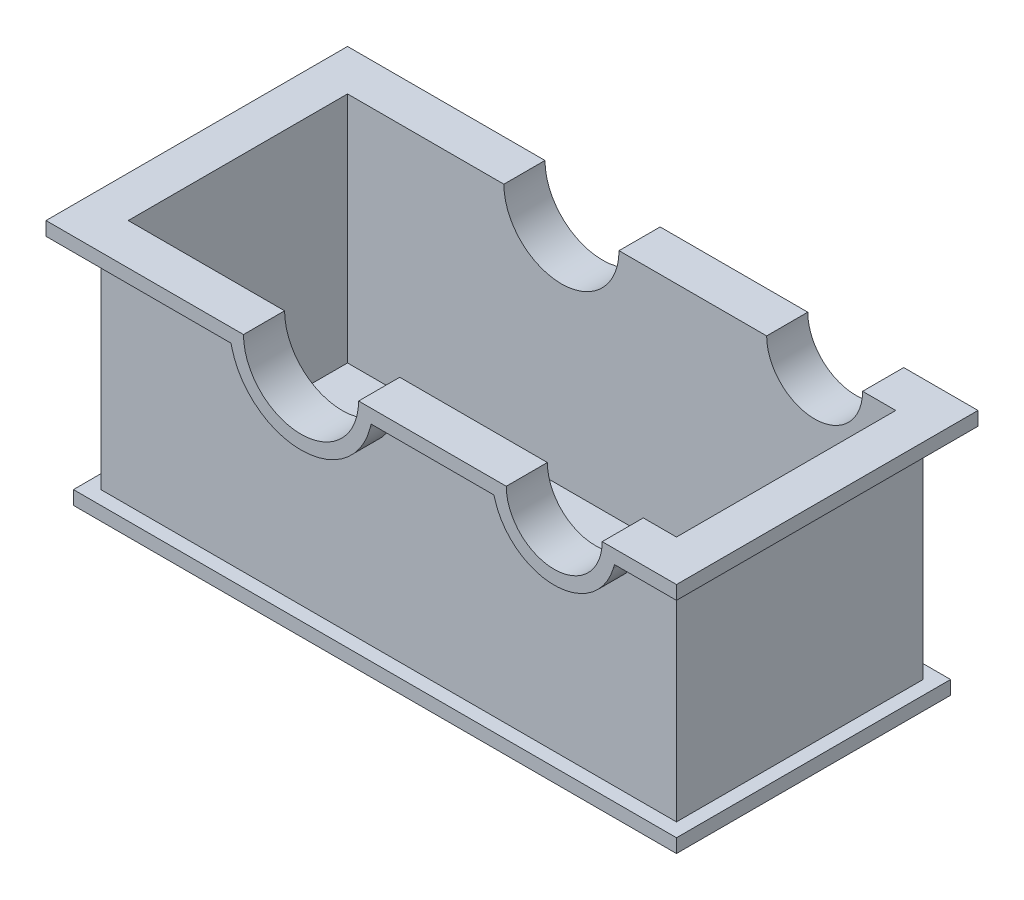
ISO-10303-21;
HEADER;
FILE_DESCRIPTION(('STEP AP214'),'2;1');
FILE_NAME('part.step','',(''),(''),'','','');
FILE_SCHEMA(('AUTOMOTIVE_DESIGN { 1 0 10303 214 1 1 1 1 }'));
ENDSEC;
DATA;
#1=APPLICATION_CONTEXT('core data for automotive mechanical design processes');
#2=APPLICATION_PROTOCOL_DEFINITION('international standard','automotive_design',2000,#1);
#3=PRODUCT_CONTEXT('',#1,'mechanical');
#4=PRODUCT('Part','Part','',(#3));
#5=PRODUCT_RELATED_PRODUCT_CATEGORY('part','',(#4));
#6=PRODUCT_DEFINITION_FORMATION('','',#4);
#7=PRODUCT_DEFINITION_CONTEXT('part definition',#1,'design');
#8=PRODUCT_DEFINITION('design','',#6,#7);
#9=PRODUCT_DEFINITION_SHAPE('','',#8);
#10=(LENGTH_UNIT() NAMED_UNIT(*) SI_UNIT(.MILLI.,.METRE.));
#11=(NAMED_UNIT(*) PLANE_ANGLE_UNIT() SI_UNIT($,.RADIAN.));
#12=(NAMED_UNIT(*) SI_UNIT($,.STERADIAN.) SOLID_ANGLE_UNIT());
#13=UNCERTAINTY_MEASURE_WITH_UNIT(LENGTH_MEASURE(1.E-05),#10,'distance_accuracy_value','');
#14=(GEOMETRIC_REPRESENTATION_CONTEXT(3) GLOBAL_UNCERTAINTY_ASSIGNED_CONTEXT((#13)) GLOBAL_UNIT_ASSIGNED_CONTEXT((#10,
#11,#12)) REPRESENTATION_CONTEXT('',''));
#15=CARTESIAN_POINT('',(0.,0.,0.));
#16=DIRECTION('',(0.,0.,1.));
#17=DIRECTION('',(1.,0.,0.));
#18=AXIS2_PLACEMENT_3D('',#15,#16,#17);
#19=CARTESIAN_POINT('',(0.,85.,0.));
#20=DIRECTION('',(0.,1.,0.));
#21=DIRECTION('',(0.,0.,1.));
#22=AXIS2_PLACEMENT_3D('',#19,#20,#21);
#23=PLANE('',#22);
#24=DIRECTION('',(0.,0.,1.));
#25=VECTOR('',#24,1.);
#26=CARTESIAN_POINT('',(108.583492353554,85.,-100.));
#27=LINE('',#26,#25);
#28=CARTESIAN_POINT('',(108.583492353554,85.,-100.));
#29=VERTEX_POINT('',#28);
#30=CARTESIAN_POINT('',(108.583492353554,85.,-90.));
#31=VERTEX_POINT('',#30);
#32=EDGE_CURVE('E326',#29,#31,#27,.T.);
#33=ORIENTED_EDGE('',*,*,#32,.F.);
#34=DIRECTION('',(-1.,0.,0.));
#35=VECTOR('',#34,1.);
#36=CARTESIAN_POINT('',(-10.,85.,-100.));
#37=LINE('',#36,#35);
#38=CARTESIAN_POINT('',(153.411363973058,85.,-100.));
#39=VERTEX_POINT('',#38);
#40=EDGE_CURVE('E474',#39,#29,#37,.T.);
#41=ORIENTED_EDGE('',*,*,#40,.F.);
#42=DIRECTION('',(0.,0.,1.));
#43=VECTOR('',#42,1.);
#44=CARTESIAN_POINT('',(153.411363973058,85.,-100.));
#45=LINE('',#44,#43);
#46=CARTESIAN_POINT('',(153.411363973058,85.,-90.));
#47=VERTEX_POINT('',#46);
#48=EDGE_CURVE('E349',#39,#47,#45,.T.);
#49=ORIENTED_EDGE('',*,*,#48,.T.);
#50=DIRECTION('',(-1.,0.,0.));
#51=VECTOR('',#50,1.);
#52=CARTESIAN_POINT('',(0.,85.,-90.));
#53=LINE('',#52,#51);
#54=EDGE_CURVE('E521',#47,#31,#53,.T.);
#55=ORIENTED_EDGE('',*,*,#54,.T.);
#56=EDGE_LOOP('',(#33,#41,#49,#55));
#57=FACE_BOUND('',#56,.T.);
#58=ADVANCED_FACE('F44',(#57),#23,.F.);
#59=CARTESIAN_POINT('',(0.,85.,-90.));
#60=DIRECTION('',(0.,0.,1.));
#61=DIRECTION('',(1.,0.,0.));
#62=AXIS2_PLACEMENT_3D('',#59,#60,#61);
#63=PLANE('',#62);
#64=DIRECTION('',(-0.238095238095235,0.971241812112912,0.));
#65=VECTOR('',#64,1.);
#66=CARTESIAN_POINT('',(57.7870786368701,83.8095238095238,-90.));
#67=LINE('',#66,#65);
#68=CARTESIAN_POINT('',(57.7870786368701,83.8095238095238,-90.));
#69=VERTEX_POINT('',#68);
#70=CARTESIAN_POINT('',(57.4952391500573,85.,-90.));
#71=VERTEX_POINT('',#70);
#72=EDGE_CURVE('E59',#69,#71,#67,.T.);
#73=ORIENTED_EDGE('',*,*,#72,.F.);
#74=CARTESIAN_POINT('',(83.0393657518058,90.,-90.));
#75=DIRECTION('',(0.,0.,-1.));
#76=DIRECTION('',(-1.,0.,0.));
#77=AXIS2_PLACEMENT_3D('',#74,#75,#76);
#78=CIRCLE('',#77,26.);
#79=CARTESIAN_POINT('',(108.291652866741,83.8095238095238,-90.));
#80=VERTEX_POINT('',#79);
#81=EDGE_CURVE('E64',#80,#69,#78,.T.);
#82=ORIENTED_EDGE('',*,*,#81,.F.);
#83=DIRECTION('',(-0.238095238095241,-0.971241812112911,0.));
#84=VECTOR('',#83,1.);
#85=CARTESIAN_POINT('',(108.291652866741,83.8095238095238,-90.));
#86=LINE('',#85,#84);
#87=EDGE_CURVE('E318',#31,#80,#86,.T.);
#88=ORIENTED_EDGE('',*,*,#87,.F.);
#89=ORIENTED_EDGE('',*,*,#54,.F.);
#90=DIRECTION('',(-0.285714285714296,0.958314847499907,0.));
#91=VECTOR('',#90,1.);
#92=CARTESIAN_POINT('',(153.837281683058,83.5714285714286,-90.));
#93=LINE('',#92,#91);
#94=CARTESIAN_POINT('',(153.837281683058,83.5714285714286,-90.));
#95=VERTEX_POINT('',#94);
#96=EDGE_CURVE('E324',#95,#47,#93,.T.);
#97=ORIENTED_EDGE('',*,*,#96,.F.);
#98=CARTESIAN_POINT('',(175.399365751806,90.,-90.));
#99=DIRECTION('',(0.,0.,-1.));
#100=DIRECTION('',(-1.,0.,0.));
#101=AXIS2_PLACEMENT_3D('',#98,#99,#100);
#102=CIRCLE('',#101,22.5);
#103=CARTESIAN_POINT('',(196.961449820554,83.5714285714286,-90.));
#104=VERTEX_POINT('',#103);
#105=EDGE_CURVE('E321',#104,#95,#102,.T.);
#106=ORIENTED_EDGE('',*,*,#105,.F.);
#107=DIRECTION('',(-0.285714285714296,-0.958314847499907,0.));
#108=VECTOR('',#107,1.);
#109=CARTESIAN_POINT('',(196.961449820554,83.5714285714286,-90.));
#110=LINE('',#109,#108);
#111=CARTESIAN_POINT('',(197.387367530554,85.,-90.));
#112=VERTEX_POINT('',#111);
#113=EDGE_CURVE('E334',#112,#104,#110,.T.);
#114=ORIENTED_EDGE('',*,*,#113,.F.);
#115=CARTESIAN_POINT('',(210.,85.,-90.));
#116=VERTEX_POINT('',#115);
#117=EDGE_CURVE('E517',#116,#112,#53,.T.);
#118=ORIENTED_EDGE('',*,*,#117,.F.);
#119=DIRECTION('',(0.,-1.,0.));
#120=VECTOR('',#119,1.);
#121=CARTESIAN_POINT('',(210.,85.,-90.));
#122=LINE('',#121,#120);
#123=CARTESIAN_POINT('',(210.,5.,-90.));
#124=VERTEX_POINT('',#123);
#125=EDGE_CURVE('E538',#116,#124,#122,.T.);
#126=ORIENTED_EDGE('',*,*,#125,.T.);
#127=DIRECTION('',(-1.,0.,0.));
#128=VECTOR('',#127,1.);
#129=CARTESIAN_POINT('',(0.,5.,-90.));
#130=LINE('',#129,#128);
#131=CARTESIAN_POINT('',(0.,5.,-90.));
#132=VERTEX_POINT('',#131);
#133=EDGE_CURVE('E529',#124,#132,#130,.T.);
#134=ORIENTED_EDGE('',*,*,#133,.T.);
#135=DIRECTION('',(0.,-1.,0.));
#136=VECTOR('',#135,1.);
#137=CARTESIAN_POINT('',(0.,85.,-90.));
#138=LINE('',#137,#136);
#139=CARTESIAN_POINT('',(0.,85.,-90.));
#140=VERTEX_POINT('',#139);
#141=EDGE_CURVE('E536',#140,#132,#138,.T.);
#142=ORIENTED_EDGE('',*,*,#141,.F.);
#143=EDGE_CURVE('E516',#71,#140,#53,.T.);
#144=ORIENTED_EDGE('',*,*,#143,.F.);
#145=EDGE_LOOP('',(#73,#82,#88,#89,#97,#106,#114,#118,#126,#134,#142,#144));
#146=FACE_BOUND('',#145,.T.);
#147=ADVANCED_FACE('F664',(#146),#63,.F.);
#148=DIRECTION('',(0.,0.,1.));
#149=VECTOR('',#148,1.);
#150=CARTESIAN_POINT('',(57.4952391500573,85.,-100.));
#151=LINE('',#150,#149);
#152=CARTESIAN_POINT('',(57.4952391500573,85.,-100.));
#153=VERTEX_POINT('',#152);
#154=EDGE_CURVE('E305',#153,#71,#151,.T.);
#155=ORIENTED_EDGE('',*,*,#154,.T.);
#156=ORIENTED_EDGE('',*,*,#143,.T.);
#157=DIRECTION('',(0.,0.,1.));
#158=VECTOR('',#157,1.);
#159=CARTESIAN_POINT('',(0.,85.,0.));
#160=LINE('',#159,#158);
#161=CARTESIAN_POINT('',(0.,85.,0.));
#162=VERTEX_POINT('',#161);
#163=EDGE_CURVE('E520',#140,#162,#160,.T.);
#164=ORIENTED_EDGE('',*,*,#163,.T.);
#165=DIRECTION('',(1.,0.,0.));
#166=VECTOR('',#165,1.);
#167=CARTESIAN_POINT('',(0.,85.,0.));
#168=LINE('',#167,#166);
#169=CARTESIAN_POINT('',(57.4952391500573,85.,0.));
#170=VERTEX_POINT('',#169);
#171=EDGE_CURVE('E508',#162,#170,#168,.T.);
#172=ORIENTED_EDGE('',*,*,#171,.T.);
#173=DIRECTION('',(0.,0.,-1.));
#174=VECTOR('',#173,1.);
#175=CARTESIAN_POINT('',(57.4952391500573,85.,10.));
#176=LINE('',#175,#174);
#177=CARTESIAN_POINT('',(57.4952391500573,85.,10.));
#178=VERTEX_POINT('',#177);
#179=EDGE_CURVE('E405',#178,#170,#176,.T.);
#180=ORIENTED_EDGE('',*,*,#179,.F.);
#181=DIRECTION('',(1.,0.,0.));
#182=VECTOR('',#181,1.);
#183=CARTESIAN_POINT('',(-10.,85.,10.));
#184=LINE('',#183,#182);
#185=CARTESIAN_POINT('',(-10.,85.,10.));
#186=VERTEX_POINT('',#185);
#187=EDGE_CURVE('E464',#186,#178,#184,.T.);
#188=ORIENTED_EDGE('',*,*,#187,.F.);
#189=DIRECTION('',(0.,0.,1.));
#190=VECTOR('',#189,1.);
#191=CARTESIAN_POINT('',(-10.,85.,10.));
#192=LINE('',#191,#190);
#193=CARTESIAN_POINT('',(-10.,85.,-100.));
#194=VERTEX_POINT('',#193);
#195=EDGE_CURVE('E473',#194,#186,#192,.T.);
#196=ORIENTED_EDGE('',*,*,#195,.F.);
#197=EDGE_CURVE('E470',#153,#194,#37,.T.);
#198=ORIENTED_EDGE('',*,*,#197,.F.);
#199=EDGE_LOOP('',(#155,#156,#164,#172,#180,#188,#196,#198));
#200=FACE_BOUND('',#199,.T.);
#201=ADVANCED_FACE('F667',(#200),#23,.F.);
#202=DIRECTION('',(0.,0.,1.));
#203=VECTOR('',#202,1.);
#204=CARTESIAN_POINT('',(197.387367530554,85.,-100.));
#205=LINE('',#204,#203);
#206=CARTESIAN_POINT('',(197.387367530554,85.,-100.));
#207=VERTEX_POINT('',#206);
#208=EDGE_CURVE('E346',#207,#112,#205,.T.);
#209=ORIENTED_EDGE('',*,*,#208,.F.);
#210=CARTESIAN_POINT('',(220.,85.,-100.));
#211=VERTEX_POINT('',#210);
#212=EDGE_CURVE('E471',#211,#207,#37,.T.);
#213=ORIENTED_EDGE('',*,*,#212,.F.);
#214=DIRECTION('',(0.,0.,-1.));
#215=VECTOR('',#214,1.);
#216=CARTESIAN_POINT('',(220.,85.,10.));
#217=LINE('',#216,#215);
#218=CARTESIAN_POINT('',(220.,85.,10.));
#219=VERTEX_POINT('',#218);
#220=EDGE_CURVE('E467',#219,#211,#217,.T.);
#221=ORIENTED_EDGE('',*,*,#220,.F.);
#222=CARTESIAN_POINT('',(197.387367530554,85.,10.));
#223=VERTEX_POINT('',#222);
#224=EDGE_CURVE('E448',#223,#219,#184,.T.);
#225=ORIENTED_EDGE('',*,*,#224,.F.);
#226=DIRECTION('',(0.,0.,-1.));
#227=VECTOR('',#226,1.);
#228=CARTESIAN_POINT('',(197.387367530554,85.,10.));
#229=LINE('',#228,#227);
#230=CARTESIAN_POINT('',(197.387367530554,85.,0.));
#231=VERTEX_POINT('',#230);
#232=EDGE_CURVE('E363',#223,#231,#229,.T.);
#233=ORIENTED_EDGE('',*,*,#232,.T.);
#234=CARTESIAN_POINT('',(210.,85.,0.));
#235=VERTEX_POINT('',#234);
#236=EDGE_CURVE('E513',#231,#235,#168,.T.);
#237=ORIENTED_EDGE('',*,*,#236,.T.);
#238=DIRECTION('',(0.,0.,-1.));
#239=VECTOR('',#238,1.);
#240=CARTESIAN_POINT('',(210.,85.,0.));
#241=LINE('',#240,#239);
#242=EDGE_CURVE('E511',#235,#116,#241,.T.);
#243=ORIENTED_EDGE('',*,*,#242,.T.);
#244=ORIENTED_EDGE('',*,*,#117,.T.);
#245=EDGE_LOOP('',(#209,#213,#221,#225,#233,#237,#243,#244));
#246=FACE_BOUND('',#245,.T.);
#247=ADVANCED_FACE('F648',(#246),#23,.F.);
#248=DIRECTION('',(0.,0.,-1.));
#249=VECTOR('',#248,1.);
#250=CARTESIAN_POINT('',(153.411363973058,85.,10.));
#251=LINE('',#250,#249);
#252=CARTESIAN_POINT('',(153.411363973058,85.,10.));
#253=VERTEX_POINT('',#252);
#254=CARTESIAN_POINT('',(153.411363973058,85.,0.));
#255=VERTEX_POINT('',#254);
#256=EDGE_CURVE('E378',#253,#255,#251,.T.);
#257=ORIENTED_EDGE('',*,*,#256,.F.);
#258=CARTESIAN_POINT('',(108.583492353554,85.,10.));
#259=VERTEX_POINT('',#258);
#260=EDGE_CURVE('E468',#259,#253,#184,.T.);
#261=ORIENTED_EDGE('',*,*,#260,.F.);
#262=DIRECTION('',(0.,0.,-1.));
#263=VECTOR('',#262,1.);
#264=CARTESIAN_POINT('',(108.583492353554,85.,10.));
#265=LINE('',#264,#263);
#266=CARTESIAN_POINT('',(108.583492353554,85.,0.));
#267=VERTEX_POINT('',#266);
#268=EDGE_CURVE('E390',#259,#267,#265,.T.);
#269=ORIENTED_EDGE('',*,*,#268,.T.);
#270=EDGE_CURVE('E512',#267,#255,#168,.T.);
#271=ORIENTED_EDGE('',*,*,#270,.T.);
#272=EDGE_LOOP('',(#257,#261,#269,#271));
#273=FACE_BOUND('',#272,.T.);
#274=ADVANCED_FACE('F701',(#273),#23,.F.);
#275=CARTESIAN_POINT('',(0.,85.,0.));
#276=DIRECTION('',(0.,0.,-1.));
#277=DIRECTION('',(-1.,0.,0.));
#278=AXIS2_PLACEMENT_3D('',#275,#276,#277);
#279=PLANE('',#278);
#280=DIRECTION('',(0.285714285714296,-0.958314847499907,0.));
#281=VECTOR('',#280,1.);
#282=CARTESIAN_POINT('',(153.837281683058,83.5714285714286,0.));
#283=LINE('',#282,#281);
#284=CARTESIAN_POINT('',(153.837281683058,83.5714285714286,0.));
#285=VERTEX_POINT('',#284);
#286=EDGE_CURVE('E354',#255,#285,#283,.T.);
#287=ORIENTED_EDGE('',*,*,#286,.F.);
#288=ORIENTED_EDGE('',*,*,#270,.F.);
#289=DIRECTION('',(0.238095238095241,0.971241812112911,0.));
#290=VECTOR('',#289,1.);
#291=CARTESIAN_POINT('',(108.291652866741,83.8095238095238,0.));
#292=LINE('',#291,#290);
#293=CARTESIAN_POINT('',(108.291652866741,83.8095238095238,0.));
#294=VERTEX_POINT('',#293);
#295=EDGE_CURVE('E385',#294,#267,#292,.T.);
#296=ORIENTED_EDGE('',*,*,#295,.F.);
#297=CARTESIAN_POINT('',(83.0393657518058,90.,0.));
#298=DIRECTION('',(0.,0.,1.));
#299=DIRECTION('',(1.,0.,0.));
#300=AXIS2_PLACEMENT_3D('',#297,#298,#299);
#301=CIRCLE('',#300,26.);
#302=CARTESIAN_POINT('',(57.7870786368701,83.8095238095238,0.));
#303=VERTEX_POINT('',#302);
#304=EDGE_CURVE('E393',#303,#294,#301,.T.);
#305=ORIENTED_EDGE('',*,*,#304,.F.);
#306=DIRECTION('',(0.238095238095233,-0.971241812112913,0.));
#307=VECTOR('',#306,1.);
#308=CARTESIAN_POINT('',(57.7870786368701,83.8095238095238,0.));
#309=LINE('',#308,#307);
#310=EDGE_CURVE('E381',#170,#303,#309,.T.);
#311=ORIENTED_EDGE('',*,*,#310,.F.);
#312=ORIENTED_EDGE('',*,*,#171,.F.);
#313=DIRECTION('',(0.,-1.,0.));
#314=VECTOR('',#313,1.);
#315=CARTESIAN_POINT('',(0.,85.,0.));
#316=LINE('',#315,#314);
#317=CARTESIAN_POINT('',(0.,5.,0.));
#318=VERTEX_POINT('',#317);
#319=EDGE_CURVE('E524',#162,#318,#316,.T.);
#320=ORIENTED_EDGE('',*,*,#319,.T.);
#321=DIRECTION('',(1.,0.,0.));
#322=VECTOR('',#321,1.);
#323=CARTESIAN_POINT('',(0.,5.,0.));
#324=LINE('',#323,#322);
#325=CARTESIAN_POINT('',(210.,5.,0.));
#326=VERTEX_POINT('',#325);
#327=EDGE_CURVE('E507',#318,#326,#324,.T.);
#328=ORIENTED_EDGE('',*,*,#327,.T.);
#329=DIRECTION('',(0.,-1.,0.));
#330=VECTOR('',#329,1.);
#331=CARTESIAN_POINT('',(210.,85.,0.));
#332=LINE('',#331,#330);
#333=EDGE_CURVE('E541',#235,#326,#332,.T.);
#334=ORIENTED_EDGE('',*,*,#333,.F.);
#335=ORIENTED_EDGE('',*,*,#236,.F.);
#336=DIRECTION('',(0.285714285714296,0.958314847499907,0.));
#337=VECTOR('',#336,1.);
#338=CARTESIAN_POINT('',(196.961449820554,83.5714285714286,0.));
#339=LINE('',#338,#337);
#340=CARTESIAN_POINT('',(196.961449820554,83.5714285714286,0.));
#341=VERTEX_POINT('',#340);
#342=EDGE_CURVE('E358',#341,#231,#339,.T.);
#343=ORIENTED_EDGE('',*,*,#342,.F.);
#344=CARTESIAN_POINT('',(175.399365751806,90.,0.));
#345=DIRECTION('',(0.,0.,1.));
#346=DIRECTION('',(1.,0.,0.));
#347=AXIS2_PLACEMENT_3D('',#344,#345,#346);
#348=CIRCLE('',#347,22.5);
#349=EDGE_CURVE('E366',#285,#341,#348,.T.);
#350=ORIENTED_EDGE('',*,*,#349,.F.);
#351=EDGE_LOOP('',(#287,#288,#296,#305,#311,#312,#320,#328,#334,#335,#343,#350));
#352=FACE_BOUND('',#351,.T.);
#353=ADVANCED_FACE('F676',(#352),#279,.F.);
#354=CARTESIAN_POINT('',(0.,90.,0.));
#355=DIRECTION('',(0.,1.,0.));
#356=DIRECTION('',(0.,0.,1.));
#357=AXIS2_PLACEMENT_3D('',#354,#355,#356);
#358=PLANE('',#357);
#359=DIRECTION('',(0.,0.,1.));
#360=VECTOR('',#359,1.);
#361=CARTESIAN_POINT('',(62.0393657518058,90.,-100.));
#362=LINE('',#361,#360);
#363=CARTESIAN_POINT('',(62.0393657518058,90.,-100.));
#364=VERTEX_POINT('',#363);
#365=CARTESIAN_POINT('',(62.0393657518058,90.,-85.));
#366=VERTEX_POINT('',#365);
#367=EDGE_CURVE('E430',#364,#366,#362,.T.);
#368=ORIENTED_EDGE('',*,*,#367,.F.);
#369=DIRECTION('',(-1.,0.,0.));
#370=VECTOR('',#369,1.);
#371=CARTESIAN_POINT('',(-10.,90.,-100.));
#372=LINE('',#371,#370);
#373=CARTESIAN_POINT('',(-10.,90.,-100.));
#374=VERTEX_POINT('',#373);
#375=EDGE_CURVE('E456',#364,#374,#372,.T.);
#376=ORIENTED_EDGE('',*,*,#375,.T.);
#377=DIRECTION('',(0.,0.,1.));
#378=VECTOR('',#377,1.);
#379=CARTESIAN_POINT('',(-10.,90.,10.));
#380=LINE('',#379,#378);
#381=CARTESIAN_POINT('',(-10.,90.,10.));
#382=VERTEX_POINT('',#381);
#383=EDGE_CURVE('E460',#374,#382,#380,.T.);
#384=ORIENTED_EDGE('',*,*,#383,.T.);
#385=DIRECTION('',(1.,0.,0.));
#386=VECTOR('',#385,1.);
#387=CARTESIAN_POINT('',(-10.,90.,10.));
#388=LINE('',#387,#386);
#389=CARTESIAN_POINT('',(62.0393657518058,90.,10.));
#390=VERTEX_POINT('',#389);
#391=EDGE_CURVE('E449',#382,#390,#388,.T.);
#392=ORIENTED_EDGE('',*,*,#391,.T.);
#393=CARTESIAN_POINT('',(62.0393657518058,90.,-5.));
#394=VERTEX_POINT('',#393);
#395=EDGE_CURVE('E426',#394,#390,#362,.T.);
#396=ORIENTED_EDGE('',*,*,#395,.F.);
#397=DIRECTION('',(1.,0.,0.));
#398=VECTOR('',#397,1.);
#399=CARTESIAN_POINT('',(5.,90.,-5.));
#400=LINE('',#399,#398);
#401=CARTESIAN_POINT('',(5.,90.,-5.));
#402=VERTEX_POINT('',#401);
#403=EDGE_CURVE('E432',#402,#394,#400,.T.);
#404=ORIENTED_EDGE('',*,*,#403,.F.);
#405=DIRECTION('',(0.,0.,1.));
#406=VECTOR('',#405,1.);
#407=CARTESIAN_POINT('',(5.,90.,-5.));
#408=LINE('',#407,#406);
#409=CARTESIAN_POINT('',(5.,90.,-85.));
#410=VERTEX_POINT('',#409);
#411=EDGE_CURVE('E444',#410,#402,#408,.T.);
#412=ORIENTED_EDGE('',*,*,#411,.F.);
#413=DIRECTION('',(-1.,0.,0.));
#414=VECTOR('',#413,1.);
#415=CARTESIAN_POINT('',(5.,90.,-85.));
#416=LINE('',#415,#414);
#417=EDGE_CURVE('E440',#366,#410,#416,.T.);
#418=ORIENTED_EDGE('',*,*,#417,.F.);
#419=EDGE_LOOP('',(#368,#376,#384,#392,#396,#404,#412,#418));
#420=FACE_BOUND('',#419,.T.);
#421=ADVANCED_FACE('F608',(#420),#358,.T.);
#422=DIRECTION('',(0.,0.,1.));
#423=VECTOR('',#422,1.);
#424=CARTESIAN_POINT('',(104.039365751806,90.,-100.));
#425=LINE('',#424,#423);
#426=CARTESIAN_POINT('',(104.039365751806,90.,10.));
#427=VERTEX_POINT('',#426);
#428=CARTESIAN_POINT('',(104.039365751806,90.,-5.));
#429=VERTEX_POINT('',#428);
#430=EDGE_CURVE('E424',#427,#429,#425,.F.);
#431=ORIENTED_EDGE('',*,*,#430,.F.);
#432=CARTESIAN_POINT('',(157.899365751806,90.,10.));
#433=VERTEX_POINT('',#432);
#434=EDGE_CURVE('E453',#427,#433,#388,.T.);
#435=ORIENTED_EDGE('',*,*,#434,.T.);
#436=DIRECTION('',(0.,0.,1.));
#437=VECTOR('',#436,1.);
#438=CARTESIAN_POINT('',(157.899365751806,90.,-100.));
#439=LINE('',#438,#437);
#440=CARTESIAN_POINT('',(157.899365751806,90.,-5.));
#441=VERTEX_POINT('',#440);
#442=EDGE_CURVE('E418',#441,#433,#439,.T.);
#443=ORIENTED_EDGE('',*,*,#442,.F.);
#444=EDGE_CURVE('E436',#429,#441,#400,.T.);
#445=ORIENTED_EDGE('',*,*,#444,.F.);
#446=EDGE_LOOP('',(#431,#435,#443,#445));
#447=FACE_BOUND('',#446,.T.);
#448=ADVANCED_FACE('F587',(#447),#358,.T.);
#449=CARTESIAN_POINT('',(104.039365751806,90.,-85.));
#450=VERTEX_POINT('',#449);
#451=CARTESIAN_POINT('',(104.039365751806,90.,-100.));
#452=VERTEX_POINT('',#451);
#453=EDGE_CURVE('E427',#450,#452,#425,.F.);
#454=ORIENTED_EDGE('',*,*,#453,.F.);
#455=CARTESIAN_POINT('',(157.899365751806,90.,-85.));
#456=VERTEX_POINT('',#455);
#457=EDGE_CURVE('E445',#456,#450,#416,.T.);
#458=ORIENTED_EDGE('',*,*,#457,.F.);
#459=CARTESIAN_POINT('',(157.899365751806,90.,-100.));
#460=VERTEX_POINT('',#459);
#461=EDGE_CURVE('E422',#460,#456,#439,.T.);
#462=ORIENTED_EDGE('',*,*,#461,.F.);
#463=EDGE_CURVE('E461',#460,#452,#372,.T.);
#464=ORIENTED_EDGE('',*,*,#463,.T.);
#465=EDGE_LOOP('',(#454,#458,#462,#464));
#466=FACE_BOUND('',#465,.T.);
#467=ADVANCED_FACE('F604',(#466),#358,.T.);
#468=CARTESIAN_POINT('',(0.,5.,0.));
#469=DIRECTION('',(0.,1.,0.));
#470=DIRECTION('',(0.,0.,1.));
#471=AXIS2_PLACEMENT_3D('',#468,#469,#470);
#472=PLANE('',#471);
#473=DIRECTION('',(1.,0.,0.));
#474=VECTOR('',#473,1.);
#475=CARTESIAN_POINT('',(-5.,5.,5.));
#476=LINE('',#475,#474);
#477=CARTESIAN_POINT('',(-5.,5.,5.));
#478=VERTEX_POINT('',#477);
#479=CARTESIAN_POINT('',(215.,5.,5.));
#480=VERTEX_POINT('',#479);
#481=EDGE_CURVE('E544',#478,#480,#476,.T.);
#482=ORIENTED_EDGE('',*,*,#481,.T.);
#483=DIRECTION('',(0.,0.,-1.));
#484=VECTOR('',#483,1.);
#485=CARTESIAN_POINT('',(215.,5.,5.));
#486=LINE('',#485,#484);
#487=CARTESIAN_POINT('',(215.,5.,-95.));
#488=VERTEX_POINT('',#487);
#489=EDGE_CURVE('E547',#480,#488,#486,.T.);
#490=ORIENTED_EDGE('',*,*,#489,.T.);
#491=DIRECTION('',(1.,0.,0.));
#492=VECTOR('',#491,1.);
#493=CARTESIAN_POINT('',(-5.,5.,-95.));
#494=LINE('',#493,#492);
#495=CARTESIAN_POINT('',(-5.,5.,-95.));
#496=VERTEX_POINT('',#495);
#497=EDGE_CURVE('E550',#496,#488,#494,.T.);
#498=ORIENTED_EDGE('',*,*,#497,.F.);
#499=DIRECTION('',(0.,0.,-1.));
#500=VECTOR('',#499,1.);
#501=CARTESIAN_POINT('',(-5.,5.,5.));
#502=LINE('',#501,#500);
#503=EDGE_CURVE('E553',#478,#496,#502,.T.);
#504=ORIENTED_EDGE('',*,*,#503,.F.);
#505=EDGE_LOOP('',(#482,#490,#498,#504));
#506=FACE_BOUND('',#505,.T.);
#507=DIRECTION('',(0.,0.,-1.));
#508=VECTOR('',#507,1.);
#509=CARTESIAN_POINT('',(210.,5.,0.));
#510=LINE('',#509,#508);
#511=EDGE_CURVE('E527',#326,#124,#510,.T.);
#512=ORIENTED_EDGE('',*,*,#511,.F.);
#513=ORIENTED_EDGE('',*,*,#327,.F.);
#514=DIRECTION('',(0.,0.,1.));
#515=VECTOR('',#514,1.);
#516=CARTESIAN_POINT('',(0.,5.,0.));
#517=LINE('',#516,#515);
#518=EDGE_CURVE('E532',#132,#318,#517,.T.);
#519=ORIENTED_EDGE('',*,*,#518,.F.);
#520=ORIENTED_EDGE('',*,*,#133,.F.);
#521=EDGE_LOOP('',(#512,#513,#519,#520));
#522=FACE_BOUND('',#521,.T.);
#523=ADVANCED_FACE('F680',(#506,#522),#472,.T.);
#524=CARTESIAN_POINT('',(-5.,5.,5.));
#525=DIRECTION('',(0.,0.,-1.));
#526=DIRECTION('',(-1.,0.,0.));
#527=AXIS2_PLACEMENT_3D('',#524,#525,#526);
#528=PLANE('',#527);
#529=DIRECTION('',(1.,0.,0.));
#530=VECTOR('',#529,1.);
#531=CARTESIAN_POINT('',(-5.,0.,5.));
#532=LINE('',#531,#530);
#533=CARTESIAN_POINT('',(-5.,0.,5.));
#534=VERTEX_POINT('',#533);
#535=CARTESIAN_POINT('',(215.,0.,5.));
#536=VERTEX_POINT('',#535);
#537=EDGE_CURVE('E543',#534,#536,#532,.T.);
#538=ORIENTED_EDGE('',*,*,#537,.T.);
#539=DIRECTION('',(0.,-1.,0.));
#540=VECTOR('',#539,1.);
#541=CARTESIAN_POINT('',(215.,5.,5.));
#542=LINE('',#541,#540);
#543=EDGE_CURVE('E572',#480,#536,#542,.T.);
#544=ORIENTED_EDGE('',*,*,#543,.F.);
#545=ORIENTED_EDGE('',*,*,#481,.F.);
#546=DIRECTION('',(0.,-1.,0.));
#547=VECTOR('',#546,1.);
#548=CARTESIAN_POINT('',(-5.,5.,5.));
#549=LINE('',#548,#547);
#550=EDGE_CURVE('E556',#478,#534,#549,.T.);
#551=ORIENTED_EDGE('',*,*,#550,.T.);
#552=EDGE_LOOP('',(#538,#544,#545,#551));
#553=FACE_BOUND('',#552,.T.);
#554=ADVANCED_FACE('F46',(#553),#528,.F.);
#555=CARTESIAN_POINT('',(215.,5.,5.));
#556=DIRECTION('',(-1.,0.,0.));
#557=DIRECTION('',(0.,0.,1.));
#558=AXIS2_PLACEMENT_3D('',#555,#556,#557);
#559=PLANE('',#558);
#560=DIRECTION('',(0.,0.,-1.));
#561=VECTOR('',#560,1.);
#562=CARTESIAN_POINT('',(215.,0.,5.));
#563=LINE('',#562,#561);
#564=CARTESIAN_POINT('',(215.,0.,-95.));
#565=VERTEX_POINT('',#564);
#566=EDGE_CURVE('E559',#536,#565,#563,.T.);
#567=ORIENTED_EDGE('',*,*,#566,.T.);
#568=DIRECTION('',(0.,-1.,0.));
#569=VECTOR('',#568,1.);
#570=CARTESIAN_POINT('',(215.,5.,-95.));
#571=LINE('',#570,#569);
#572=EDGE_CURVE('E570',#488,#565,#571,.T.);
#573=ORIENTED_EDGE('',*,*,#572,.F.);
#574=ORIENTED_EDGE('',*,*,#489,.F.);
#575=ORIENTED_EDGE('',*,*,#543,.T.);
#576=EDGE_LOOP('',(#567,#573,#574,#575));
#577=FACE_BOUND('',#576,.T.);
#578=ADVANCED_FACE('F984',(#577),#559,.F.);
#579=CARTESIAN_POINT('',(-5.,5.,-95.));
#580=DIRECTION('',(0.,0.,-1.));
#581=DIRECTION('',(-1.,0.,0.));
#582=AXIS2_PLACEMENT_3D('',#579,#580,#581);
#583=PLANE('',#582);
#584=DIRECTION('',(1.,0.,0.));
#585=VECTOR('',#584,1.);
#586=CARTESIAN_POINT('',(-5.,0.,-95.));
#587=LINE('',#586,#585);
#588=CARTESIAN_POINT('',(-5.,0.,-95.));
#589=VERTEX_POINT('',#588);
#590=EDGE_CURVE('E562',#589,#565,#587,.T.);
#591=ORIENTED_EDGE('',*,*,#590,.F.);
#592=DIRECTION('',(0.,-1.,0.));
#593=VECTOR('',#592,1.);
#594=CARTESIAN_POINT('',(-5.,5.,-95.));
#595=LINE('',#594,#593);
#596=EDGE_CURVE('E568',#496,#589,#595,.T.);
#597=ORIENTED_EDGE('',*,*,#596,.F.);
#598=ORIENTED_EDGE('',*,*,#497,.T.);
#599=ORIENTED_EDGE('',*,*,#572,.T.);
#600=EDGE_LOOP('',(#591,#597,#598,#599));
#601=FACE_BOUND('',#600,.T.);
#602=ADVANCED_FACE('F974',(#601),#583,.T.);
#603=CARTESIAN_POINT('',(-5.,5.,5.));
#604=DIRECTION('',(-1.,0.,0.));
#605=DIRECTION('',(0.,0.,1.));
#606=AXIS2_PLACEMENT_3D('',#603,#604,#605);
#607=PLANE('',#606);
#608=DIRECTION('',(0.,0.,-1.));
#609=VECTOR('',#608,1.);
#610=CARTESIAN_POINT('',(-5.,0.,5.));
#611=LINE('',#610,#609);
#612=EDGE_CURVE('E548',#534,#589,#611,.T.);
#613=ORIENTED_EDGE('',*,*,#612,.F.);
#614=ORIENTED_EDGE('',*,*,#550,.F.);
#615=ORIENTED_EDGE('',*,*,#503,.T.);
#616=ORIENTED_EDGE('',*,*,#596,.T.);
#617=EDGE_LOOP('',(#613,#614,#615,#616));
#618=FACE_BOUND('',#617,.T.);
#619=ADVANCED_FACE('F965',(#618),#607,.T.);
#620=CARTESIAN_POINT('',(0.,0.,0.));
#621=DIRECTION('',(0.,1.,0.));
#622=DIRECTION('',(0.,0.,1.));
#623=AXIS2_PLACEMENT_3D('',#620,#621,#622);
#624=PLANE('',#623);
#625=ORIENTED_EDGE('',*,*,#537,.F.);
#626=ORIENTED_EDGE('',*,*,#612,.T.);
#627=ORIENTED_EDGE('',*,*,#590,.T.);
#628=ORIENTED_EDGE('',*,*,#566,.F.);
#629=EDGE_LOOP('',(#625,#626,#627,#628));
#630=FACE_BOUND('',#629,.T.);
#631=ADVANCED_FACE('F939',(#630),#624,.F.);
#632=CARTESIAN_POINT('',(210.,85.,0.));
#633=DIRECTION('',(-1.,0.,0.));
#634=DIRECTION('',(0.,0.,1.));
#635=AXIS2_PLACEMENT_3D('',#632,#633,#634);
#636=PLANE('',#635);
#637=ORIENTED_EDGE('',*,*,#511,.T.);
#638=ORIENTED_EDGE('',*,*,#125,.F.);
#639=ORIENTED_EDGE('',*,*,#242,.F.);
#640=ORIENTED_EDGE('',*,*,#333,.T.);
#641=EDGE_LOOP('',(#637,#638,#639,#640));
#642=FACE_BOUND('',#641,.T.);
#643=ADVANCED_FACE('F682',(#642),#636,.F.);
#644=CARTESIAN_POINT('',(0.,85.,0.));
#645=DIRECTION('',(1.,0.,0.));
#646=DIRECTION('',(0.,0.,-1.));
#647=AXIS2_PLACEMENT_3D('',#644,#645,#646);
#648=PLANE('',#647);
#649=ORIENTED_EDGE('',*,*,#518,.T.);
#650=ORIENTED_EDGE('',*,*,#319,.F.);
#651=ORIENTED_EDGE('',*,*,#163,.F.);
#652=ORIENTED_EDGE('',*,*,#141,.T.);
#653=EDGE_LOOP('',(#649,#650,#651,#652));
#654=FACE_BOUND('',#653,.T.);
#655=ADVANCED_FACE('F673',(#654),#648,.F.);
#656=DIRECTION('',(0.,0.,1.));
#657=VECTOR('',#656,1.);
#658=CARTESIAN_POINT('',(192.899365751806,90.,-100.));
#659=LINE('',#658,#657);
#660=CARTESIAN_POINT('',(192.899365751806,90.,10.));
#661=VERTEX_POINT('',#660);
#662=CARTESIAN_POINT('',(192.899365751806,90.,-5.));
#663=VERTEX_POINT('',#662);
#664=EDGE_CURVE('E411',#661,#663,#659,.F.);
#665=ORIENTED_EDGE('',*,*,#664,.F.);
#666=CARTESIAN_POINT('',(220.,90.,10.));
#667=VERTEX_POINT('',#666);
#668=EDGE_CURVE('E454',#661,#667,#388,.T.);
#669=ORIENTED_EDGE('',*,*,#668,.T.);
#670=DIRECTION('',(0.,0.,-1.));
#671=VECTOR('',#670,1.);
#672=CARTESIAN_POINT('',(220.,90.,10.));
#673=LINE('',#672,#671);
#674=CARTESIAN_POINT('',(220.,90.,-100.));
#675=VERTEX_POINT('',#674);
#676=EDGE_CURVE('E452',#667,#675,#673,.T.);
#677=ORIENTED_EDGE('',*,*,#676,.T.);
#678=CARTESIAN_POINT('',(192.899365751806,90.,-100.));
#679=VERTEX_POINT('',#678);
#680=EDGE_CURVE('E457',#675,#679,#372,.T.);
#681=ORIENTED_EDGE('',*,*,#680,.T.);
#682=CARTESIAN_POINT('',(192.899365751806,90.,-85.));
#683=VERTEX_POINT('',#682);
#684=EDGE_CURVE('E419',#683,#679,#659,.F.);
#685=ORIENTED_EDGE('',*,*,#684,.F.);
#686=CARTESIAN_POINT('',(205.,90.,-85.));
#687=VERTEX_POINT('',#686);
#688=EDGE_CURVE('E441',#687,#683,#416,.T.);
#689=ORIENTED_EDGE('',*,*,#688,.F.);
#690=DIRECTION('',(0.,0.,-1.));
#691=VECTOR('',#690,1.);
#692=CARTESIAN_POINT('',(205.,90.,-5.));
#693=LINE('',#692,#691);
#694=CARTESIAN_POINT('',(205.,90.,-5.));
#695=VERTEX_POINT('',#694);
#696=EDGE_CURVE('E435',#695,#687,#693,.T.);
#697=ORIENTED_EDGE('',*,*,#696,.F.);
#698=EDGE_CURVE('E437',#663,#695,#400,.T.);
#699=ORIENTED_EDGE('',*,*,#698,.F.);
#700=EDGE_LOOP('',(#665,#669,#677,#681,#685,#689,#697,#699));
#701=FACE_BOUND('',#700,.T.);
#702=ADVANCED_FACE('F638',(#701),#358,.T.);
#703=CARTESIAN_POINT('',(-10.,90.,10.));
#704=DIRECTION('',(0.,0.,-1.));
#705=DIRECTION('',(-1.,0.,0.));
#706=AXIS2_PLACEMENT_3D('',#703,#704,#705);
#707=PLANE('',#706);
#708=ORIENTED_EDGE('',*,*,#187,.T.);
#709=DIRECTION('',(0.238095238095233,-0.971241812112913,0.));
#710=VECTOR('',#709,1.);
#711=CARTESIAN_POINT('',(57.7870786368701,83.8095238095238,10.));
#712=LINE('',#711,#710);
#713=CARTESIAN_POINT('',(57.7870786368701,83.8095238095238,10.));
#714=VERTEX_POINT('',#713);
#715=EDGE_CURVE('E382',#178,#714,#712,.T.);
#716=ORIENTED_EDGE('',*,*,#715,.T.);
#717=CARTESIAN_POINT('',(83.0393657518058,90.,10.));
#718=DIRECTION('',(0.,0.,1.));
#719=DIRECTION('',(1.,0.,0.));
#720=AXIS2_PLACEMENT_3D('',#717,#718,#719);
#721=CIRCLE('',#720,26.);
#722=CARTESIAN_POINT('',(108.291652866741,83.8095238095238,10.));
#723=VERTEX_POINT('',#722);
#724=EDGE_CURVE('E384',#714,#723,#721,.T.);
#725=ORIENTED_EDGE('',*,*,#724,.T.);
#726=DIRECTION('',(0.238095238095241,0.971241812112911,0.));
#727=VECTOR('',#726,1.);
#728=CARTESIAN_POINT('',(108.291652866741,83.8095238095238,10.));
#729=LINE('',#728,#727);
#730=EDGE_CURVE('E387',#723,#259,#729,.T.);
#731=ORIENTED_EDGE('',*,*,#730,.T.);
#732=ORIENTED_EDGE('',*,*,#260,.T.);
#733=DIRECTION('',(0.285714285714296,-0.958314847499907,0.));
#734=VECTOR('',#733,1.);
#735=CARTESIAN_POINT('',(153.837281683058,83.5714285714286,10.));
#736=LINE('',#735,#734);
#737=CARTESIAN_POINT('',(153.837281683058,83.5714285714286,10.));
#738=VERTEX_POINT('',#737);
#739=EDGE_CURVE('E355',#253,#738,#736,.T.);
#740=ORIENTED_EDGE('',*,*,#739,.T.);
#741=CARTESIAN_POINT('',(175.399365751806,90.,10.));
#742=DIRECTION('',(0.,0.,1.));
#743=DIRECTION('',(1.,0.,0.));
#744=AXIS2_PLACEMENT_3D('',#741,#742,#743);
#745=CIRCLE('',#744,22.5);
#746=CARTESIAN_POINT('',(196.961449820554,83.5714285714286,10.));
#747=VERTEX_POINT('',#746);
#748=EDGE_CURVE('E357',#738,#747,#745,.T.);
#749=ORIENTED_EDGE('',*,*,#748,.T.);
#750=DIRECTION('',(0.285714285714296,0.958314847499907,0.));
#751=VECTOR('',#750,1.);
#752=CARTESIAN_POINT('',(196.961449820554,83.5714285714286,10.));
#753=LINE('',#752,#751);
#754=EDGE_CURVE('E360',#747,#223,#753,.T.);
#755=ORIENTED_EDGE('',*,*,#754,.T.);
#756=ORIENTED_EDGE('',*,*,#224,.T.);
#757=DIRECTION('',(0.,-1.,0.));
#758=VECTOR('',#757,1.);
#759=CARTESIAN_POINT('',(220.,90.,10.));
#760=LINE('',#759,#758);
#761=EDGE_CURVE('E484',#667,#219,#760,.T.);
#762=ORIENTED_EDGE('',*,*,#761,.F.);
#763=ORIENTED_EDGE('',*,*,#668,.F.);
#764=CARTESIAN_POINT('',(175.399365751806,90.,10.));
#765=DIRECTION('',(0.,0.,1.));
#766=DIRECTION('',(1.,0.,0.));
#767=AXIS2_PLACEMENT_3D('',#764,#765,#766);
#768=CIRCLE('',#767,17.5);
#769=EDGE_CURVE('E408',#433,#661,#768,.T.);
#770=ORIENTED_EDGE('',*,*,#769,.F.);
#771=ORIENTED_EDGE('',*,*,#434,.F.);
#772=CARTESIAN_POINT('',(83.0393657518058,90.,10.));
#773=DIRECTION('',(0.,0.,1.));
#774=DIRECTION('',(1.,0.,0.));
#775=AXIS2_PLACEMENT_3D('',#772,#773,#774);
#776=CIRCLE('',#775,21.);
#777=EDGE_CURVE('E412',#390,#427,#776,.T.);
#778=ORIENTED_EDGE('',*,*,#777,.F.);
#779=ORIENTED_EDGE('',*,*,#391,.F.);
#780=DIRECTION('',(0.,-1.,0.));
#781=VECTOR('',#780,1.);
#782=CARTESIAN_POINT('',(-10.,90.,10.));
#783=LINE('',#782,#781);
#784=EDGE_CURVE('E463',#382,#186,#783,.T.);
#785=ORIENTED_EDGE('',*,*,#784,.T.);
#786=EDGE_LOOP('',(#708,#716,#725,#731,#732,#740,#749,#755,#756,#762,#763,#770,#771,#778,#779,#785));
#787=FACE_BOUND('',#786,.T.);
#788=ADVANCED_FACE('F619',(#787),#707,.F.);
#789=CARTESIAN_POINT('',(220.,90.,10.));
#790=DIRECTION('',(-1.,0.,0.));
#791=DIRECTION('',(0.,0.,1.));
#792=AXIS2_PLACEMENT_3D('',#789,#790,#791);
#793=PLANE('',#792);
#794=ORIENTED_EDGE('',*,*,#220,.T.);
#795=DIRECTION('',(0.,-1.,0.));
#796=VECTOR('',#795,1.);
#797=CARTESIAN_POINT('',(220.,90.,-100.));
#798=LINE('',#797,#796);
#799=EDGE_CURVE('E481',#675,#211,#798,.T.);
#800=ORIENTED_EDGE('',*,*,#799,.F.);
#801=ORIENTED_EDGE('',*,*,#676,.F.);
#802=ORIENTED_EDGE('',*,*,#761,.T.);
#803=EDGE_LOOP('',(#794,#800,#801,#802));
#804=FACE_BOUND('',#803,.T.);
#805=ADVANCED_FACE('F706',(#804),#793,.F.);
#806=CARTESIAN_POINT('',(-10.,90.,-100.));
#807=DIRECTION('',(0.,0.,1.));
#808=DIRECTION('',(1.,0.,0.));
#809=AXIS2_PLACEMENT_3D('',#806,#807,#808);
#810=PLANE('',#809);
#811=ORIENTED_EDGE('',*,*,#212,.T.);
#812=DIRECTION('',(-0.285714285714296,-0.958314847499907,0.));
#813=VECTOR('',#812,1.);
#814=CARTESIAN_POINT('',(196.961449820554,83.5714285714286,-100.));
#815=LINE('',#814,#813);
#816=CARTESIAN_POINT('',(196.961449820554,83.5714285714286,-100.));
#817=VERTEX_POINT('',#816);
#818=EDGE_CURVE('E337',#207,#817,#815,.T.);
#819=ORIENTED_EDGE('',*,*,#818,.T.);
#820=CARTESIAN_POINT('',(175.399365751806,90.,-100.));
#821=DIRECTION('',(0.,0.,-1.));
#822=DIRECTION('',(-1.,0.,0.));
#823=AXIS2_PLACEMENT_3D('',#820,#821,#822);
#824=CIRCLE('',#823,22.5);
#825=CARTESIAN_POINT('',(153.837281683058,83.5714285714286,-100.));
#826=VERTEX_POINT('',#825);
#827=EDGE_CURVE('E330',#817,#826,#824,.T.);
#828=ORIENTED_EDGE('',*,*,#827,.T.);
#829=DIRECTION('',(-0.285714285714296,0.958314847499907,0.));
#830=VECTOR('',#829,1.);
#831=CARTESIAN_POINT('',(153.837281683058,83.5714285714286,-100.));
#832=LINE('',#831,#830);
#833=EDGE_CURVE('E333',#826,#39,#832,.T.);
#834=ORIENTED_EDGE('',*,*,#833,.T.);
#835=ORIENTED_EDGE('',*,*,#40,.T.);
#836=DIRECTION('',(-0.238095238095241,-0.971241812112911,0.));
#837=VECTOR('',#836,1.);
#838=CARTESIAN_POINT('',(108.291652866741,83.8095238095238,-100.));
#839=LINE('',#838,#837);
#840=CARTESIAN_POINT('',(108.291652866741,83.8095238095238,-100.));
#841=VERTEX_POINT('',#840);
#842=EDGE_CURVE('E307',#29,#841,#839,.T.);
#843=ORIENTED_EDGE('',*,*,#842,.T.);
#844=CARTESIAN_POINT('',(83.0393657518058,90.,-100.));
#845=DIRECTION('',(0.,0.,-1.));
#846=DIRECTION('',(-1.,0.,0.));
#847=AXIS2_PLACEMENT_3D('',#844,#845,#846);
#848=CIRCLE('',#847,26.);
#849=CARTESIAN_POINT('',(57.7870786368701,83.8095238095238,-100.));
#850=VERTEX_POINT('',#849);
#851=EDGE_CURVE('E308',#841,#850,#848,.T.);
#852=ORIENTED_EDGE('',*,*,#851,.T.);
#853=DIRECTION('',(-0.238095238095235,0.971241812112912,0.));
#854=VECTOR('',#853,1.);
#855=CARTESIAN_POINT('',(57.7870786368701,83.8095238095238,-100.));
#856=LINE('',#855,#854);
#857=EDGE_CURVE('E300',#850,#153,#856,.T.);
#858=ORIENTED_EDGE('',*,*,#857,.T.);
#859=ORIENTED_EDGE('',*,*,#197,.T.);
#860=DIRECTION('',(0.,-1.,0.));
#861=VECTOR('',#860,1.);
#862=CARTESIAN_POINT('',(-10.,90.,-100.));
#863=LINE('',#862,#861);
#864=EDGE_CURVE('E478',#374,#194,#863,.T.);
#865=ORIENTED_EDGE('',*,*,#864,.F.);
#866=ORIENTED_EDGE('',*,*,#375,.F.);
#867=CARTESIAN_POINT('',(83.0393657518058,90.,-100.));
#868=DIRECTION('',(0.,0.,1.));
#869=DIRECTION('',(1.,0.,0.));
#870=AXIS2_PLACEMENT_3D('',#867,#868,#869);
#871=CIRCLE('',#870,21.);
#872=EDGE_CURVE('E409',#364,#452,#871,.T.);
#873=ORIENTED_EDGE('',*,*,#872,.T.);
#874=ORIENTED_EDGE('',*,*,#463,.F.);
#875=CARTESIAN_POINT('',(175.399365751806,90.,-100.));
#876=DIRECTION('',(0.,0.,1.));
#877=DIRECTION('',(1.,0.,0.));
#878=AXIS2_PLACEMENT_3D('',#875,#876,#877);
#879=CIRCLE('',#878,17.5);
#880=EDGE_CURVE('E414',#460,#679,#879,.T.);
#881=ORIENTED_EDGE('',*,*,#880,.T.);
#882=ORIENTED_EDGE('',*,*,#680,.F.);
#883=ORIENTED_EDGE('',*,*,#799,.T.);
#884=EDGE_LOOP('',(#811,#819,#828,#834,#835,#843,#852,#858,#859,#865,#866,#873,#874,#881,#882,#883));
#885=FACE_BOUND('',#884,.T.);
#886=ADVANCED_FACE('F312',(#885),#810,.F.);
#887=CARTESIAN_POINT('',(-10.,90.,10.));
#888=DIRECTION('',(1.,0.,0.));
#889=DIRECTION('',(0.,0.,-1.));
#890=AXIS2_PLACEMENT_3D('',#887,#888,#889);
#891=PLANE('',#890);
#892=ORIENTED_EDGE('',*,*,#195,.T.);
#893=ORIENTED_EDGE('',*,*,#784,.F.);
#894=ORIENTED_EDGE('',*,*,#383,.F.);
#895=ORIENTED_EDGE('',*,*,#864,.T.);
#896=EDGE_LOOP('',(#892,#893,#894,#895));
#897=FACE_BOUND('',#896,.T.);
#898=ADVANCED_FACE('F614',(#897),#891,.F.);
#899=DIRECTION('',(1.,0.,0.));
#900=VECTOR('',#899,1.);
#901=CARTESIAN_POINT('',(5.,5.,-5.));
#902=LINE('',#901,#900);
#903=CARTESIAN_POINT('',(5.,5.,-5.));
#904=VERTEX_POINT('',#903);
#905=CARTESIAN_POINT('',(205.,5.,-5.));
#906=VERTEX_POINT('',#905);
#907=EDGE_CURVE('E487',#904,#906,#902,.T.);
#908=ORIENTED_EDGE('',*,*,#907,.T.);
#909=DIRECTION('',(0.,0.,-1.));
#910=VECTOR('',#909,1.);
#911=CARTESIAN_POINT('',(205.,5.,-5.));
#912=LINE('',#911,#910);
#913=CARTESIAN_POINT('',(205.,5.,-85.));
#914=VERTEX_POINT('',#913);
#915=EDGE_CURVE('E489',#906,#914,#912,.T.);
#916=ORIENTED_EDGE('',*,*,#915,.T.);
#917=DIRECTION('',(-1.,0.,0.));
#918=VECTOR('',#917,1.);
#919=CARTESIAN_POINT('',(5.,5.,-85.));
#920=LINE('',#919,#918);
#921=CARTESIAN_POINT('',(5.,5.,-85.));
#922=VERTEX_POINT('',#921);
#923=EDGE_CURVE('E491',#914,#922,#920,.T.);
#924=ORIENTED_EDGE('',*,*,#923,.T.);
#925=DIRECTION('',(0.,0.,1.));
#926=VECTOR('',#925,1.);
#927=CARTESIAN_POINT('',(5.,5.,-5.));
#928=LINE('',#927,#926);
#929=EDGE_CURVE('E493',#922,#904,#928,.T.);
#930=ORIENTED_EDGE('',*,*,#929,.T.);
#931=EDGE_LOOP('',(#908,#916,#924,#930));
#932=FACE_BOUND('',#931,.T.);
#933=ADVANCED_FACE('F865',(#932),#472,.T.);
#934=CARTESIAN_POINT('',(5.,85.,-85.));
#935=DIRECTION('',(0.,0.,1.));
#936=DIRECTION('',(1.,0.,0.));
#937=AXIS2_PLACEMENT_3D('',#934,#935,#936);
#938=PLANE('',#937);
#939=CARTESIAN_POINT('',(83.0393657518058,90.,-85.));
#940=DIRECTION('',(0.,0.,1.));
#941=DIRECTION('',(1.,0.,0.));
#942=AXIS2_PLACEMENT_3D('',#939,#940,#941);
#943=CIRCLE('',#942,21.);
#944=EDGE_CURVE('E429',#366,#450,#943,.T.);
#945=ORIENTED_EDGE('',*,*,#944,.F.);
#946=ORIENTED_EDGE('',*,*,#417,.T.);
#947=DIRECTION('',(0.,-1.,0.));
#948=VECTOR('',#947,1.);
#949=CARTESIAN_POINT('',(5.,85.,-85.));
#950=LINE('',#949,#948);
#951=EDGE_CURVE('E498',#410,#922,#950,.T.);
#952=ORIENTED_EDGE('',*,*,#951,.T.);
#953=ORIENTED_EDGE('',*,*,#923,.F.);
#954=DIRECTION('',(0.,-1.,0.));
#955=VECTOR('',#954,1.);
#956=CARTESIAN_POINT('',(205.,85.,-85.));
#957=LINE('',#956,#955);
#958=EDGE_CURVE('E501',#687,#914,#957,.T.);
#959=ORIENTED_EDGE('',*,*,#958,.F.);
#960=ORIENTED_EDGE('',*,*,#688,.T.);
#961=CARTESIAN_POINT('',(175.399365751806,90.,-85.));
#962=DIRECTION('',(0.,0.,1.));
#963=DIRECTION('',(1.,0.,0.));
#964=AXIS2_PLACEMENT_3D('',#961,#962,#963);
#965=CIRCLE('',#964,17.5);
#966=EDGE_CURVE('E421',#456,#683,#965,.T.);
#967=ORIENTED_EDGE('',*,*,#966,.F.);
#968=ORIENTED_EDGE('',*,*,#457,.T.);
#969=EDGE_LOOP('',(#945,#946,#952,#953,#959,#960,#967,#968));
#970=FACE_BOUND('',#969,.T.);
#971=ADVANCED_FACE('F631',(#970),#938,.T.);
#972=CARTESIAN_POINT('',(5.,85.,-5.));
#973=DIRECTION('',(1.,0.,0.));
#974=DIRECTION('',(0.,0.,-1.));
#975=AXIS2_PLACEMENT_3D('',#972,#973,#974);
#976=PLANE('',#975);
#977=ORIENTED_EDGE('',*,*,#929,.F.);
#978=ORIENTED_EDGE('',*,*,#951,.F.);
#979=ORIENTED_EDGE('',*,*,#411,.T.);
#980=DIRECTION('',(0.,-1.,0.));
#981=VECTOR('',#980,1.);
#982=CARTESIAN_POINT('',(5.,85.,-5.));
#983=LINE('',#982,#981);
#984=EDGE_CURVE('E495',#402,#904,#983,.T.);
#985=ORIENTED_EDGE('',*,*,#984,.T.);
#986=EDGE_LOOP('',(#977,#978,#979,#985));
#987=FACE_BOUND('',#986,.T.);
#988=ADVANCED_FACE('F628',(#987),#976,.T.);
#989=CARTESIAN_POINT('',(5.,85.,-5.));
#990=DIRECTION('',(0.,0.,-1.));
#991=DIRECTION('',(-1.,0.,0.));
#992=AXIS2_PLACEMENT_3D('',#989,#990,#991);
#993=PLANE('',#992);
#994=CARTESIAN_POINT('',(83.0393657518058,90.,-5.));
#995=DIRECTION('',(0.,0.,-1.));
#996=DIRECTION('',(-1.,0.,0.));
#997=AXIS2_PLACEMENT_3D('',#994,#995,#996);
#998=CIRCLE('',#997,21.);
#999=EDGE_CURVE('E13',#429,#394,#998,.T.);
#1000=ORIENTED_EDGE('',*,*,#999,.F.);
#1001=ORIENTED_EDGE('',*,*,#444,.T.);
#1002=CARTESIAN_POINT('',(175.399365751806,90.,-5.));
#1003=DIRECTION('',(0.,0.,-1.));
#1004=DIRECTION('',(-1.,0.,0.));
#1005=AXIS2_PLACEMENT_3D('',#1002,#1003,#1004);
#1006=CIRCLE('',#1005,17.5);
#1007=EDGE_CURVE('E52',#663,#441,#1006,.T.);
#1008=ORIENTED_EDGE('',*,*,#1007,.F.);
#1009=ORIENTED_EDGE('',*,*,#698,.T.);
#1010=DIRECTION('',(0.,-1.,0.));
#1011=VECTOR('',#1010,1.);
#1012=CARTESIAN_POINT('',(205.,85.,-5.));
#1013=LINE('',#1012,#1011);
#1014=EDGE_CURVE('E504',#695,#906,#1013,.T.);
#1015=ORIENTED_EDGE('',*,*,#1014,.T.);
#1016=ORIENTED_EDGE('',*,*,#907,.F.);
#1017=ORIENTED_EDGE('',*,*,#984,.F.);
#1018=ORIENTED_EDGE('',*,*,#403,.T.);
#1019=EDGE_LOOP('',(#1000,#1001,#1008,#1009,#1015,#1016,#1017,#1018));
#1020=FACE_BOUND('',#1019,.T.);
#1021=ADVANCED_FACE('F590',(#1020),#993,.T.);
#1022=CARTESIAN_POINT('',(205.,85.,-5.));
#1023=DIRECTION('',(-1.,0.,0.));
#1024=DIRECTION('',(0.,0.,1.));
#1025=AXIS2_PLACEMENT_3D('',#1022,#1023,#1024);
#1026=PLANE('',#1025);
#1027=ORIENTED_EDGE('',*,*,#915,.F.);
#1028=ORIENTED_EDGE('',*,*,#1014,.F.);
#1029=ORIENTED_EDGE('',*,*,#696,.T.);
#1030=ORIENTED_EDGE('',*,*,#958,.T.);
#1031=EDGE_LOOP('',(#1027,#1028,#1029,#1030));
#1032=FACE_BOUND('',#1031,.T.);
#1033=ADVANCED_FACE('F822',(#1032),#1026,.T.);
#1034=CARTESIAN_POINT('',(175.399365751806,90.,-100.));
#1035=DIRECTION('',(0.,0.,1.));
#1036=DIRECTION('',(1.,0.,0.));
#1037=AXIS2_PLACEMENT_3D('',#1034,#1035,#1036);
#1038=CYLINDRICAL_SURFACE('',#1037,17.5);
#1039=ORIENTED_EDGE('',*,*,#769,.T.);
#1040=ORIENTED_EDGE('',*,*,#664,.T.);
#1041=ORIENTED_EDGE('',*,*,#1007,.T.);
#1042=ORIENTED_EDGE('',*,*,#442,.T.);
#1043=EDGE_LOOP('',(#1039,#1040,#1041,#1042));
#1044=FACE_BOUND('',#1043,.T.);
#1045=ADVANCED_FACE('F577',(#1044),#1038,.F.);
#1046=CARTESIAN_POINT('',(83.0393657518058,90.,-100.));
#1047=DIRECTION('',(0.,0.,1.));
#1048=DIRECTION('',(1.,0.,0.));
#1049=AXIS2_PLACEMENT_3D('',#1046,#1047,#1048);
#1050=CYLINDRICAL_SURFACE('',#1049,21.);
#1051=ORIENTED_EDGE('',*,*,#777,.T.);
#1052=ORIENTED_EDGE('',*,*,#430,.T.);
#1053=ORIENTED_EDGE('',*,*,#999,.T.);
#1054=ORIENTED_EDGE('',*,*,#395,.T.);
#1055=EDGE_LOOP('',(#1051,#1052,#1053,#1054));
#1056=FACE_BOUND('',#1055,.T.);
#1057=ADVANCED_FACE('F808',(#1056),#1050,.F.);
#1058=ORIENTED_EDGE('',*,*,#684,.T.);
#1059=ORIENTED_EDGE('',*,*,#880,.F.);
#1060=ORIENTED_EDGE('',*,*,#461,.T.);
#1061=ORIENTED_EDGE('',*,*,#966,.T.);
#1062=EDGE_LOOP('',(#1058,#1059,#1060,#1061));
#1063=FACE_BOUND('',#1062,.T.);
#1064=ADVANCED_FACE('F636',(#1063),#1038,.F.);
#1065=ORIENTED_EDGE('',*,*,#453,.T.);
#1066=ORIENTED_EDGE('',*,*,#872,.F.);
#1067=ORIENTED_EDGE('',*,*,#367,.T.);
#1068=ORIENTED_EDGE('',*,*,#944,.T.);
#1069=EDGE_LOOP('',(#1065,#1066,#1067,#1068));
#1070=FACE_BOUND('',#1069,.T.);
#1071=ADVANCED_FACE('F598',(#1070),#1050,.F.);
#1072=CARTESIAN_POINT('',(57.7870786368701,83.8095238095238,10.));
#1073=DIRECTION('',(0.971241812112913,0.238095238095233,0.));
#1074=DIRECTION('',(-0.238095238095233,0.971241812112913,0.));
#1075=AXIS2_PLACEMENT_3D('',#1072,#1073,#1074);
#1076=PLANE('',#1075);
#1077=ORIENTED_EDGE('',*,*,#310,.T.);
#1078=DIRECTION('',(0.,0.,-1.));
#1079=VECTOR('',#1078,1.);
#1080=CARTESIAN_POINT('',(57.7870786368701,83.8095238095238,10.));
#1081=LINE('',#1080,#1079);
#1082=EDGE_CURVE('E402',#714,#303,#1081,.T.);
#1083=ORIENTED_EDGE('',*,*,#1082,.F.);
#1084=ORIENTED_EDGE('',*,*,#715,.F.);
#1085=ORIENTED_EDGE('',*,*,#179,.T.);
#1086=EDGE_LOOP('',(#1077,#1083,#1084,#1085));
#1087=FACE_BOUND('',#1086,.T.);
#1088=ADVANCED_FACE('F791',(#1087),#1076,.F.);
#1089=CARTESIAN_POINT('',(83.0393657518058,90.,10.));
#1090=DIRECTION('',(0.,0.,-1.));
#1091=DIRECTION('',(-1.,0.,0.));
#1092=AXIS2_PLACEMENT_3D('',#1089,#1090,#1091);
#1093=CYLINDRICAL_SURFACE('',#1092,26.);
#1094=ORIENTED_EDGE('',*,*,#304,.T.);
#1095=DIRECTION('',(0.,0.,-1.));
#1096=VECTOR('',#1095,1.);
#1097=CARTESIAN_POINT('',(108.291652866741,83.8095238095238,10.));
#1098=LINE('',#1097,#1096);
#1099=EDGE_CURVE('E399',#723,#294,#1098,.T.);
#1100=ORIENTED_EDGE('',*,*,#1099,.F.);
#1101=ORIENTED_EDGE('',*,*,#724,.F.);
#1102=ORIENTED_EDGE('',*,*,#1082,.T.);
#1103=EDGE_LOOP('',(#1094,#1100,#1101,#1102));
#1104=FACE_BOUND('',#1103,.T.);
#1105=ADVANCED_FACE('F781',(#1104),#1093,.T.);
#1106=CARTESIAN_POINT('',(108.291652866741,83.8095238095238,10.));
#1107=DIRECTION('',(-0.971241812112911,0.238095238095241,0.));
#1108=DIRECTION('',(-0.238095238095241,-0.971241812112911,0.));
#1109=AXIS2_PLACEMENT_3D('',#1106,#1107,#1108);
#1110=PLANE('',#1109);
#1111=ORIENTED_EDGE('',*,*,#295,.T.);
#1112=ORIENTED_EDGE('',*,*,#268,.F.);
#1113=ORIENTED_EDGE('',*,*,#730,.F.);
#1114=ORIENTED_EDGE('',*,*,#1099,.T.);
#1115=EDGE_LOOP('',(#1111,#1112,#1113,#1114));
#1116=FACE_BOUND('',#1115,.T.);
#1117=ADVANCED_FACE('F772',(#1116),#1110,.F.);
#1118=CARTESIAN_POINT('',(153.837281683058,83.5714285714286,10.));
#1119=DIRECTION('',(0.958314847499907,0.285714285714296,0.));
#1120=DIRECTION('',(-0.285714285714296,0.958314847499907,0.));
#1121=AXIS2_PLACEMENT_3D('',#1118,#1119,#1120);
#1122=PLANE('',#1121);
#1123=ORIENTED_EDGE('',*,*,#286,.T.);
#1124=DIRECTION('',(0.,0.,-1.));
#1125=VECTOR('',#1124,1.);
#1126=CARTESIAN_POINT('',(153.837281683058,83.5714285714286,10.));
#1127=LINE('',#1126,#1125);
#1128=EDGE_CURVE('E375',#738,#285,#1127,.T.);
#1129=ORIENTED_EDGE('',*,*,#1128,.F.);
#1130=ORIENTED_EDGE('',*,*,#739,.F.);
#1131=ORIENTED_EDGE('',*,*,#256,.T.);
#1132=EDGE_LOOP('',(#1123,#1129,#1130,#1131));
#1133=FACE_BOUND('',#1132,.T.);
#1134=ADVANCED_FACE('F697',(#1133),#1122,.F.);
#1135=CARTESIAN_POINT('',(175.399365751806,90.,10.));
#1136=DIRECTION('',(0.,0.,-1.));
#1137=DIRECTION('',(-1.,0.,0.));
#1138=AXIS2_PLACEMENT_3D('',#1135,#1136,#1137);
#1139=CYLINDRICAL_SURFACE('',#1138,22.5);
#1140=ORIENTED_EDGE('',*,*,#349,.T.);
#1141=DIRECTION('',(0.,0.,-1.));
#1142=VECTOR('',#1141,1.);
#1143=CARTESIAN_POINT('',(196.961449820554,83.5714285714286,10.));
#1144=LINE('',#1143,#1142);
#1145=EDGE_CURVE('E372',#747,#341,#1144,.T.);
#1146=ORIENTED_EDGE('',*,*,#1145,.F.);
#1147=ORIENTED_EDGE('',*,*,#748,.F.);
#1148=ORIENTED_EDGE('',*,*,#1128,.T.);
#1149=EDGE_LOOP('',(#1140,#1146,#1147,#1148));
#1150=FACE_BOUND('',#1149,.T.);
#1151=ADVANCED_FACE('F692',(#1150),#1139,.T.);
#1152=CARTESIAN_POINT('',(196.961449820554,83.5714285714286,10.));
#1153=DIRECTION('',(-0.958314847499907,0.285714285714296,0.));
#1154=DIRECTION('',(-0.285714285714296,-0.958314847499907,0.));
#1155=AXIS2_PLACEMENT_3D('',#1152,#1153,#1154);
#1156=PLANE('',#1155);
#1157=ORIENTED_EDGE('',*,*,#342,.T.);
#1158=ORIENTED_EDGE('',*,*,#232,.F.);
#1159=ORIENTED_EDGE('',*,*,#754,.F.);
#1160=ORIENTED_EDGE('',*,*,#1145,.T.);
#1161=EDGE_LOOP('',(#1157,#1158,#1159,#1160));
#1162=FACE_BOUND('',#1161,.T.);
#1163=ADVANCED_FACE('F687',(#1162),#1156,.F.);
#1164=CARTESIAN_POINT('',(175.399365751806,90.,-100.));
#1165=DIRECTION('',(0.,0.,1.));
#1166=DIRECTION('',(1.,0.,0.));
#1167=AXIS2_PLACEMENT_3D('',#1164,#1165,#1166);
#1168=CYLINDRICAL_SURFACE('',#1167,22.5);
#1169=ORIENTED_EDGE('',*,*,#105,.T.);
#1170=DIRECTION('',(0.,0.,1.));
#1171=VECTOR('',#1170,1.);
#1172=CARTESIAN_POINT('',(153.837281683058,83.5714285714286,-100.));
#1173=LINE('',#1172,#1171);
#1174=EDGE_CURVE('E351',#826,#95,#1173,.T.);
#1175=ORIENTED_EDGE('',*,*,#1174,.F.);
#1176=ORIENTED_EDGE('',*,*,#827,.F.);
#1177=DIRECTION('',(0.,0.,1.));
#1178=VECTOR('',#1177,1.);
#1179=CARTESIAN_POINT('',(196.961449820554,83.5714285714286,-100.));
#1180=LINE('',#1179,#1178);
#1181=EDGE_CURVE('E338',#817,#104,#1180,.T.);
#1182=ORIENTED_EDGE('',*,*,#1181,.T.);
#1183=EDGE_LOOP('',(#1169,#1175,#1176,#1182));
#1184=FACE_BOUND('',#1183,.T.);
#1185=ADVANCED_FACE('F657',(#1184),#1168,.T.);
#1186=CARTESIAN_POINT('',(153.837281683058,83.5714285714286,-100.));
#1187=DIRECTION('',(0.958314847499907,0.285714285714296,0.));
#1188=DIRECTION('',(-0.285714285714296,0.958314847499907,0.));
#1189=AXIS2_PLACEMENT_3D('',#1186,#1187,#1188);
#1190=PLANE('',#1189);
#1191=ORIENTED_EDGE('',*,*,#96,.T.);
#1192=ORIENTED_EDGE('',*,*,#48,.F.);
#1193=ORIENTED_EDGE('',*,*,#833,.F.);
#1194=ORIENTED_EDGE('',*,*,#1174,.T.);
#1195=EDGE_LOOP('',(#1191,#1192,#1193,#1194));
#1196=FACE_BOUND('',#1195,.T.);
#1197=ADVANCED_FACE('F659',(#1196),#1190,.F.);
#1198=CARTESIAN_POINT('',(196.961449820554,83.5714285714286,-100.));
#1199=DIRECTION('',(-0.958314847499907,0.285714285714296,0.));
#1200=DIRECTION('',(-0.285714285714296,-0.958314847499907,0.));
#1201=AXIS2_PLACEMENT_3D('',#1198,#1199,#1200);
#1202=PLANE('',#1201);
#1203=ORIENTED_EDGE('',*,*,#113,.T.);
#1204=ORIENTED_EDGE('',*,*,#1181,.F.);
#1205=ORIENTED_EDGE('',*,*,#818,.F.);
#1206=ORIENTED_EDGE('',*,*,#208,.T.);
#1207=EDGE_LOOP('',(#1203,#1204,#1205,#1206));
#1208=FACE_BOUND('',#1207,.T.);
#1209=ADVANCED_FACE('F651',(#1208),#1202,.F.);
#1210=CARTESIAN_POINT('',(83.0393657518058,90.,-100.));
#1211=DIRECTION('',(0.,0.,1.));
#1212=DIRECTION('',(1.,0.,0.));
#1213=AXIS2_PLACEMENT_3D('',#1210,#1211,#1212);
#1214=CYLINDRICAL_SURFACE('',#1213,26.);
#1215=ORIENTED_EDGE('',*,*,#81,.T.);
#1216=DIRECTION('',(0.,0.,1.));
#1217=VECTOR('',#1216,1.);
#1218=CARTESIAN_POINT('',(57.7870786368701,83.8095238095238,-100.));
#1219=LINE('',#1218,#1217);
#1220=EDGE_CURVE('E304',#850,#69,#1219,.T.);
#1221=ORIENTED_EDGE('',*,*,#1220,.F.);
#1222=ORIENTED_EDGE('',*,*,#851,.F.);
#1223=DIRECTION('',(0.,0.,1.));
#1224=VECTOR('',#1223,1.);
#1225=CARTESIAN_POINT('',(108.291652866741,83.8095238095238,-100.));
#1226=LINE('',#1225,#1224);
#1227=EDGE_CURVE('E1096',#841,#80,#1226,.T.);
#1228=ORIENTED_EDGE('',*,*,#1227,.T.);
#1229=EDGE_LOOP('',(#1215,#1221,#1222,#1228));
#1230=FACE_BOUND('',#1229,.T.);
#1231=ADVANCED_FACE('F320',(#1230),#1214,.T.);
#1232=CARTESIAN_POINT('',(57.7870786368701,83.8095238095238,-100.));
#1233=DIRECTION('',(0.971241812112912,0.238095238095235,0.));
#1234=DIRECTION('',(-0.238095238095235,0.971241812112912,0.));
#1235=AXIS2_PLACEMENT_3D('',#1232,#1233,#1234);
#1236=PLANE('',#1235);
#1237=ORIENTED_EDGE('',*,*,#72,.T.);
#1238=ORIENTED_EDGE('',*,*,#154,.F.);
#1239=ORIENTED_EDGE('',*,*,#857,.F.);
#1240=ORIENTED_EDGE('',*,*,#1220,.T.);
#1241=EDGE_LOOP('',(#1237,#1238,#1239,#1240));
#1242=FACE_BOUND('',#1241,.T.);
#1243=ADVANCED_FACE('F302',(#1242),#1236,.F.);
#1244=CARTESIAN_POINT('',(108.291652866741,83.8095238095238,-100.));
#1245=DIRECTION('',(-0.971241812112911,0.238095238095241,0.));
#1246=DIRECTION('',(-0.238095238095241,-0.971241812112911,0.));
#1247=AXIS2_PLACEMENT_3D('',#1244,#1245,#1246);
#1248=PLANE('',#1247);
#1249=ORIENTED_EDGE('',*,*,#87,.T.);
#1250=ORIENTED_EDGE('',*,*,#1227,.F.);
#1251=ORIENTED_EDGE('',*,*,#842,.F.);
#1252=ORIENTED_EDGE('',*,*,#32,.T.);
#1253=EDGE_LOOP('',(#1249,#1250,#1251,#1252));
#1254=FACE_BOUND('',#1253,.T.);
#1255=ADVANCED_FACE('F1080',(#1254),#1248,.F.);
#1256=CLOSED_SHELL('',(#58,#147,#201,#247,#274,#353,#421,#448,#467,#523,#554,#578,#602,#619,
#631,#643,#655,#702,#788,#805,#886,#898,#933,#971,#988,#1021,#1033,#1045,#1057,#1064,#1071,
#1088,#1105,#1117,#1134,#1151,#1163,#1185,#1197,#1209,#1231,#1243,#1255));
#1257=MANIFOLD_SOLID_BREP('B2',#1256);
#1258=ADVANCED_BREP_SHAPE_REPRESENTATION('',(#18,#1257),#14);
#1259=SHAPE_DEFINITION_REPRESENTATION(#9,#1258);
ENDSEC;
END-ISO-10303-21;
